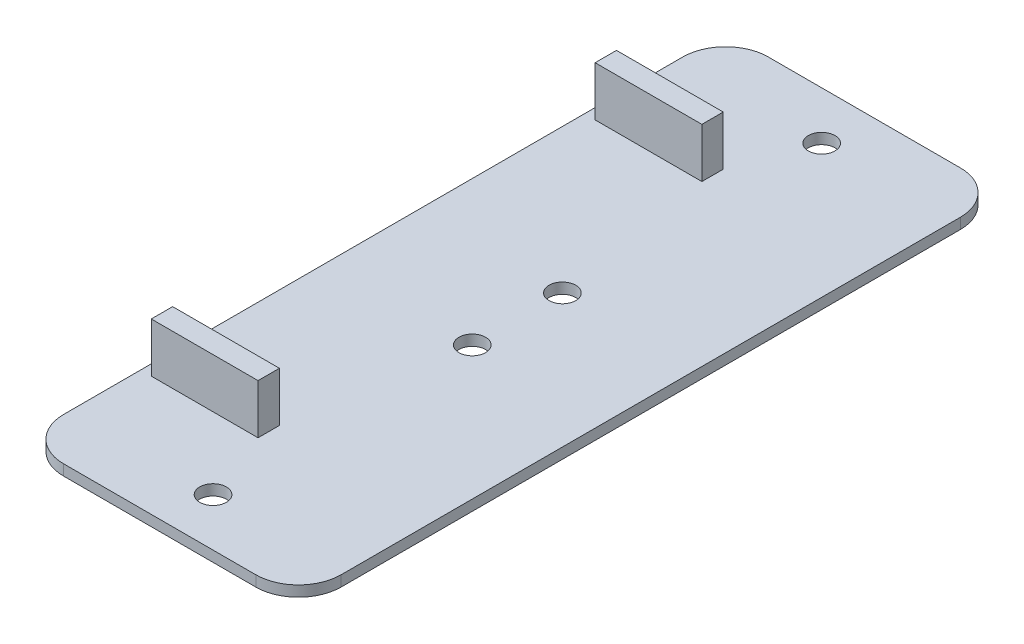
from build123d import *

# Parameters (mm, degrees)
SKETCH1_W               = 33.02
SKETCH1_H               = 83.82
BOSS_EXTRUDE1_DEPTH     = 1.27
CUT_EXTRUDE1_DEPTH      = 91.098422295
CUT_EXTRUDE1_DEPTH_BACK = 91.098422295
SKETCH3_R               = 1.5875
FILLET1_R               = 5.08
FILLET2_R               = 5.08
FILLET3_R               = 5.08
FILLET4_R               = 5.08
SKETCH2_W               = 12.7
SKETCH2_H               = 2.54
BOSS_EXTRUDE2_DEPTH     = 5.8928


with BuildPart() as part:
    # Sketch1 → Boss-Extrude1 (new body)
    with BuildSketch(Plane(origin=(0, 0, 0), x_dir=(1, 0, 0), z_dir=(0, 1, 0))):
        with Locations((16.51, 41.91)):
            Rectangle(SKETCH1_W, SKETCH1_H)
    extrude(amount=BOSS_EXTRUDE1_DEPTH)

    # Sketch3 → Cut-Extrude1 (cut, two sides: drawn at the far end of the back side and taken through both)
    with BuildSketch(Plane(origin=(0, 1.27, 0), x_dir=(1, 0, 0), z_dir=(0, 1, 0)).offset(-CUT_EXTRUDE1_DEPTH_BACK)):
        with Locations(Location((17.145, 78.105, 0), (0, 0, 90))):
            Circle(SKETCH3_R)
        with Locations(Location((17.145, 47.2694, 0), (0, 0, 90))):
            Circle(SKETCH3_R)
        with Locations(Location((17.145, 36.5506, 0), (0, 0, 90))):
            Circle(SKETCH3_R)
        with Locations(Location((17.145, 5.715, 0), (0, 0, 90))):
            Circle(SKETCH3_R)
    extrude(amount=CUT_EXTRUDE1_DEPTH + CUT_EXTRUDE1_DEPTH_BACK, mode=Mode.SUBTRACT)

    # Fillet1
    fillet1_edges = [part.edges().sort_by_distance(p)[0] for p in [
        (0, 0.635, 0),
    ]]
    fillet(fillet1_edges, radius=FILLET1_R)

    # Fillet2
    fillet2_edges = [part.edges().sort_by_distance(p)[0] for p in [
        (33.02, 0.635, 0),
    ]]
    fillet(fillet2_edges, radius=FILLET2_R)

    # Fillet3
    fillet3_edges = [part.edges().sort_by_distance(p)[0] for p in [
        (33.02, 0.635, -83.82),
    ]]
    fillet(fillet3_edges, radius=FILLET3_R)

    # Fillet4
    fillet4_edges = [part.edges().sort_by_distance(p)[0] for p in [
        (0, 0.635, -83.82),
    ]]
    fillet(fillet4_edges, radius=FILLET4_R)

    # Sketch2 → Boss-Extrude2 (add)
    with BuildSketch(Plane(origin=(0, 1.27, 0), x_dir=(1, 0, 0), z_dir=(0, 1, 0))):
        with Locations((7.62, 15.513050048)):
            Rectangle(SKETCH2_W, SKETCH2_H)
        with Locations((7.62, 68.30695)):
            Rectangle(SKETCH2_W, SKETCH2_H)
    extrude(amount=BOSS_EXTRUDE2_DEPTH)


solid = part.part
